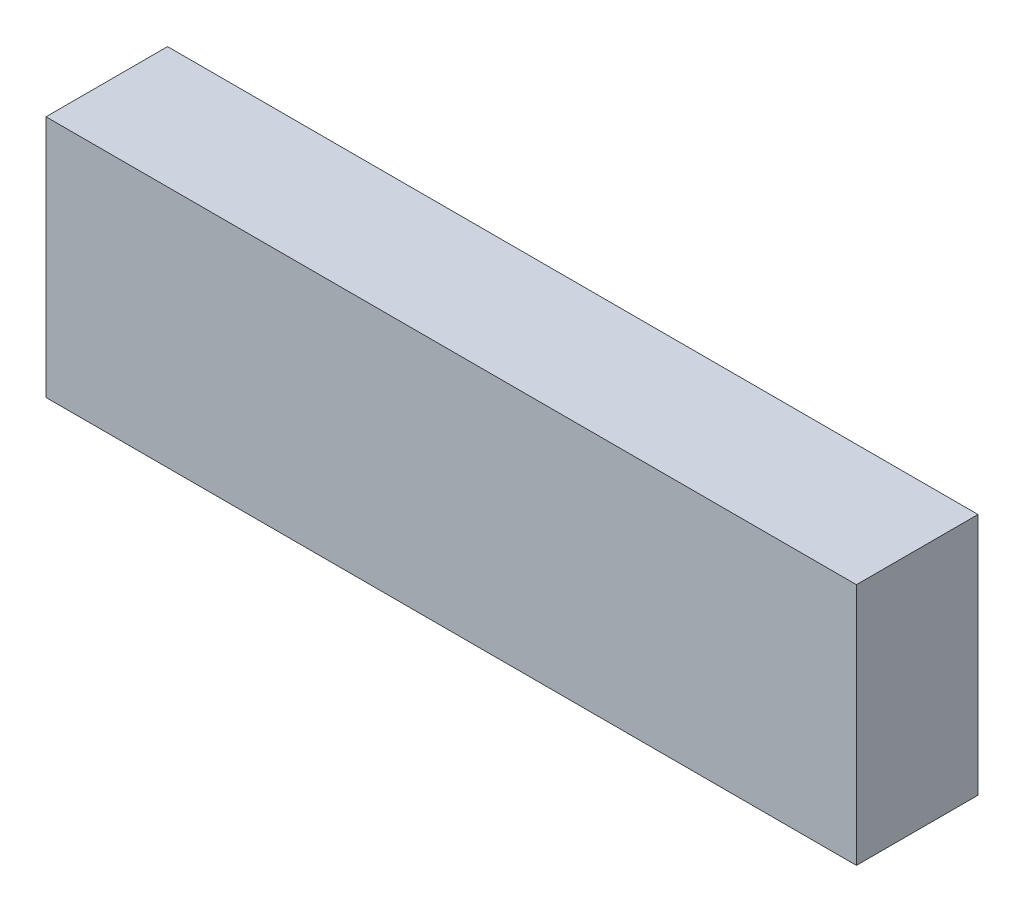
ISO-10303-21;
HEADER;
FILE_DESCRIPTION(('STEP AP214'),'2;1');
FILE_NAME('part.step','',(''),(''),'','','');
FILE_SCHEMA(('AUTOMOTIVE_DESIGN { 1 0 10303 214 1 1 1 1 }'));
ENDSEC;
DATA;
#1=APPLICATION_CONTEXT('core data for automotive mechanical design processes');
#2=APPLICATION_PROTOCOL_DEFINITION('international standard','automotive_design',2000,#1);
#3=PRODUCT_CONTEXT('',#1,'mechanical');
#4=PRODUCT('Part','Part','',(#3));
#5=PRODUCT_RELATED_PRODUCT_CATEGORY('part','',(#4));
#6=PRODUCT_DEFINITION_FORMATION('','',#4);
#7=PRODUCT_DEFINITION_CONTEXT('part definition',#1,'design');
#8=PRODUCT_DEFINITION('design','',#6,#7);
#9=PRODUCT_DEFINITION_SHAPE('','',#8);
#10=(LENGTH_UNIT() NAMED_UNIT(*) SI_UNIT(.MILLI.,.METRE.));
#11=(NAMED_UNIT(*) PLANE_ANGLE_UNIT() SI_UNIT($,.RADIAN.));
#12=(NAMED_UNIT(*) SI_UNIT($,.STERADIAN.) SOLID_ANGLE_UNIT());
#13=UNCERTAINTY_MEASURE_WITH_UNIT(LENGTH_MEASURE(1.E-05),#10,'distance_accuracy_value','');
#14=(GEOMETRIC_REPRESENTATION_CONTEXT(3) GLOBAL_UNCERTAINTY_ASSIGNED_CONTEXT((#13)) GLOBAL_UNIT_ASSIGNED_CONTEXT((#10,
#11,#12)) REPRESENTATION_CONTEXT('',''));
#15=CARTESIAN_POINT('',(0.,0.,0.));
#16=DIRECTION('',(0.,0.,1.));
#17=DIRECTION('',(1.,0.,0.));
#18=AXIS2_PLACEMENT_3D('',#15,#16,#17);
#19=CARTESIAN_POINT('',(127.,76.2,19.05));
#20=DIRECTION('',(-1.,0.,0.));
#21=DIRECTION('',(0.,0.,1.));
#22=AXIS2_PLACEMENT_3D('',#19,#20,#21);
#23=PLANE('',#22);
#24=DIRECTION('',(0.,0.,-1.));
#25=VECTOR('',#24,1.);
#26=CARTESIAN_POINT('',(127.,0.,19.05));
#27=LINE('',#26,#25);
#28=CARTESIAN_POINT('',(127.,0.,19.05));
#29=VERTEX_POINT('',#28);
#30=CARTESIAN_POINT('',(127.,0.,-19.05));
#31=VERTEX_POINT('',#30);
#32=EDGE_CURVE('E95',#29,#31,#27,.T.);
#33=ORIENTED_EDGE('',*,*,#32,.T.);
#34=DIRECTION('',(0.,-1.,0.));
#35=VECTOR('',#34,1.);
#36=CARTESIAN_POINT('',(127.,76.2,-19.05));
#37=LINE('',#36,#35);
#38=CARTESIAN_POINT('',(127.,76.2,-19.05));
#39=VERTEX_POINT('',#38);
#40=EDGE_CURVE('E11',#39,#31,#37,.T.);
#41=ORIENTED_EDGE('',*,*,#40,.F.);
#42=DIRECTION('',(0.,0.,-1.));
#43=VECTOR('',#42,1.);
#44=CARTESIAN_POINT('',(127.,76.2,19.05));
#45=LINE('',#44,#43);
#46=CARTESIAN_POINT('',(127.,76.2,19.05));
#47=VERTEX_POINT('',#46);
#48=EDGE_CURVE('E83',#47,#39,#45,.T.);
#49=ORIENTED_EDGE('',*,*,#48,.F.);
#50=DIRECTION('',(0.,-1.,0.));
#51=VECTOR('',#50,1.);
#52=CARTESIAN_POINT('',(127.,76.2,19.05));
#53=LINE('',#52,#51);
#54=EDGE_CURVE('E91',#47,#29,#53,.T.);
#55=ORIENTED_EDGE('',*,*,#54,.T.);
#56=EDGE_LOOP('',(#33,#41,#49,#55));
#57=FACE_BOUND('',#56,.T.);
#58=ADVANCED_FACE('F32',(#57),#23,.F.);
#59=CARTESIAN_POINT('',(-127.,76.2,-19.05));
#60=DIRECTION('',(0.,0.,1.));
#61=DIRECTION('',(1.,0.,0.));
#62=AXIS2_PLACEMENT_3D('',#59,#60,#61);
#63=PLANE('',#62);
#64=DIRECTION('',(-1.,0.,0.));
#65=VECTOR('',#64,1.);
#66=CARTESIAN_POINT('',(-127.,0.,-19.05));
#67=LINE('',#66,#65);
#68=CARTESIAN_POINT('',(-127.,0.,-19.05));
#69=VERTEX_POINT('',#68);
#70=EDGE_CURVE('E87',#31,#69,#67,.T.);
#71=ORIENTED_EDGE('',*,*,#70,.T.);
#72=DIRECTION('',(0.,-1.,0.));
#73=VECTOR('',#72,1.);
#74=CARTESIAN_POINT('',(-127.,76.2,-19.05));
#75=LINE('',#74,#73);
#76=CARTESIAN_POINT('',(-127.,76.2,-19.05));
#77=VERTEX_POINT('',#76);
#78=EDGE_CURVE('E40',#77,#69,#75,.T.);
#79=ORIENTED_EDGE('',*,*,#78,.F.);
#80=DIRECTION('',(-1.,0.,0.));
#81=VECTOR('',#80,1.);
#82=CARTESIAN_POINT('',(-127.,76.2,-19.05));
#83=LINE('',#82,#81);
#84=EDGE_CURVE('E78',#39,#77,#83,.T.);
#85=ORIENTED_EDGE('',*,*,#84,.F.);
#86=ORIENTED_EDGE('',*,*,#40,.T.);
#87=EDGE_LOOP('',(#71,#79,#85,#86));
#88=FACE_BOUND('',#87,.T.);
#89=ADVANCED_FACE('F86',(#88),#63,.F.);
#90=CARTESIAN_POINT('',(-127.,76.2,19.05));
#91=DIRECTION('',(1.,0.,0.));
#92=DIRECTION('',(0.,0.,-1.));
#93=AXIS2_PLACEMENT_3D('',#90,#91,#92);
#94=PLANE('',#93);
#95=DIRECTION('',(0.,0.,1.));
#96=VECTOR('',#95,1.);
#97=CARTESIAN_POINT('',(-127.,0.,19.05));
#98=LINE('',#97,#96);
#99=CARTESIAN_POINT('',(-127.,0.,19.05));
#100=VERTEX_POINT('',#99);
#101=EDGE_CURVE('E65',#69,#100,#98,.T.);
#102=ORIENTED_EDGE('',*,*,#101,.T.);
#103=DIRECTION('',(0.,-1.,0.));
#104=VECTOR('',#103,1.);
#105=CARTESIAN_POINT('',(-127.,76.2,19.05));
#106=LINE('',#105,#104);
#107=CARTESIAN_POINT('',(-127.,76.2,19.05));
#108=VERTEX_POINT('',#107);
#109=EDGE_CURVE('E88',#108,#100,#106,.T.);
#110=ORIENTED_EDGE('',*,*,#109,.F.);
#111=DIRECTION('',(0.,0.,1.));
#112=VECTOR('',#111,1.);
#113=CARTESIAN_POINT('',(-127.,76.2,19.05));
#114=LINE('',#113,#112);
#115=EDGE_CURVE('E81',#77,#108,#114,.T.);
#116=ORIENTED_EDGE('',*,*,#115,.F.);
#117=ORIENTED_EDGE('',*,*,#78,.T.);
#118=EDGE_LOOP('',(#102,#110,#116,#117));
#119=FACE_BOUND('',#118,.T.);
#120=ADVANCED_FACE('F89',(#119),#94,.F.);
#121=CARTESIAN_POINT('',(-127.,76.2,19.05));
#122=DIRECTION('',(0.,0.,-1.));
#123=DIRECTION('',(-1.,0.,0.));
#124=AXIS2_PLACEMENT_3D('',#121,#122,#123);
#125=PLANE('',#124);
#126=DIRECTION('',(1.,0.,0.));
#127=VECTOR('',#126,1.);
#128=CARTESIAN_POINT('',(-127.,0.,19.05));
#129=LINE('',#128,#127);
#130=EDGE_CURVE('E71',#100,#29,#129,.T.);
#131=ORIENTED_EDGE('',*,*,#130,.T.);
#132=ORIENTED_EDGE('',*,*,#54,.F.);
#133=DIRECTION('',(1.,0.,0.));
#134=VECTOR('',#133,1.);
#135=CARTESIAN_POINT('',(-127.,76.2,19.05));
#136=LINE('',#135,#134);
#137=EDGE_CURVE('E48',#108,#47,#136,.T.);
#138=ORIENTED_EDGE('',*,*,#137,.F.);
#139=ORIENTED_EDGE('',*,*,#109,.T.);
#140=EDGE_LOOP('',(#131,#132,#138,#139));
#141=FACE_BOUND('',#140,.T.);
#142=ADVANCED_FACE('F102',(#141),#125,.F.);
#143=CARTESIAN_POINT('',(0.,76.2,0.));
#144=DIRECTION('',(0.,-1.,0.));
#145=DIRECTION('',(0.,0.,-1.));
#146=AXIS2_PLACEMENT_3D('',#143,#144,#145);
#147=PLANE('',#146);
#148=ORIENTED_EDGE('',*,*,#48,.T.);
#149=ORIENTED_EDGE('',*,*,#84,.T.);
#150=ORIENTED_EDGE('',*,*,#115,.T.);
#151=ORIENTED_EDGE('',*,*,#137,.T.);
#152=EDGE_LOOP('',(#148,#149,#150,#151));
#153=FACE_BOUND('',#152,.T.);
#154=ADVANCED_FACE('F79',(#153),#147,.F.);
#155=CARTESIAN_POINT('',(0.,0.,0.));
#156=DIRECTION('',(0.,-1.,0.));
#157=DIRECTION('',(0.,0.,-1.));
#158=AXIS2_PLACEMENT_3D('',#155,#156,#157);
#159=PLANE('',#158);
#160=ORIENTED_EDGE('',*,*,#32,.F.);
#161=ORIENTED_EDGE('',*,*,#130,.F.);
#162=ORIENTED_EDGE('',*,*,#101,.F.);
#163=ORIENTED_EDGE('',*,*,#70,.F.);
#164=EDGE_LOOP('',(#160,#161,#162,#163));
#165=FACE_BOUND('',#164,.T.);
#166=ADVANCED_FACE('F105',(#165),#159,.T.);
#167=CLOSED_SHELL('',(#58,#89,#120,#142,#154,#166));
#168=MANIFOLD_SOLID_BREP('B2',#167);
#169=ADVANCED_BREP_SHAPE_REPRESENTATION('',(#18,#168),#14);
#170=SHAPE_DEFINITION_REPRESENTATION(#9,#169);
ENDSEC;
END-ISO-10303-21;
